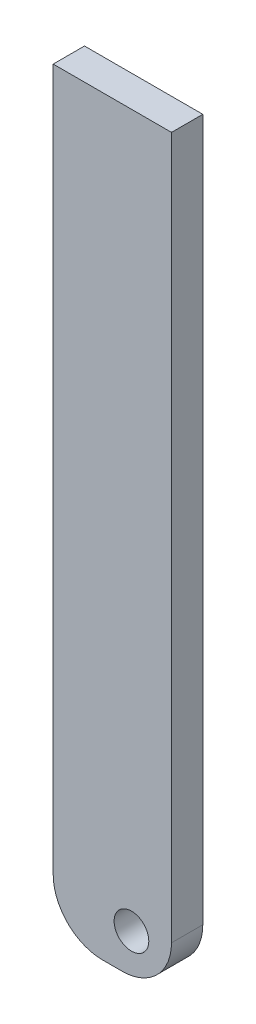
ISO-10303-21;
HEADER;
FILE_DESCRIPTION(('STEP AP214'),'2;1');
FILE_NAME('part.step','',(''),(''),'','','');
FILE_SCHEMA(('AUTOMOTIVE_DESIGN { 1 0 10303 214 1 1 1 1 }'));
ENDSEC;
DATA;
#1=APPLICATION_CONTEXT('core data for automotive mechanical design processes');
#2=APPLICATION_PROTOCOL_DEFINITION('international standard','automotive_design',2000,#1);
#3=PRODUCT_CONTEXT('',#1,'mechanical');
#4=PRODUCT('Part','Part','',(#3));
#5=PRODUCT_RELATED_PRODUCT_CATEGORY('part','',(#4));
#6=PRODUCT_DEFINITION_FORMATION('','',#4);
#7=PRODUCT_DEFINITION_CONTEXT('part definition',#1,'design');
#8=PRODUCT_DEFINITION('design','',#6,#7);
#9=PRODUCT_DEFINITION_SHAPE('','',#8);
#10=(LENGTH_UNIT() NAMED_UNIT(*) SI_UNIT(.MILLI.,.METRE.));
#11=(NAMED_UNIT(*) PLANE_ANGLE_UNIT() SI_UNIT($,.RADIAN.));
#12=(NAMED_UNIT(*) SI_UNIT($,.STERADIAN.) SOLID_ANGLE_UNIT());
#13=UNCERTAINTY_MEASURE_WITH_UNIT(LENGTH_MEASURE(1.E-05),#10,'distance_accuracy_value','');
#14=(GEOMETRIC_REPRESENTATION_CONTEXT(3) GLOBAL_UNCERTAINTY_ASSIGNED_CONTEXT((#13)) GLOBAL_UNIT_ASSIGNED_CONTEXT((#10,
#11,#12)) REPRESENTATION_CONTEXT('',''));
#15=CARTESIAN_POINT('',(0.,0.,0.));
#16=DIRECTION('',(0.,0.,1.));
#17=DIRECTION('',(1.,0.,0.));
#18=AXIS2_PLACEMENT_3D('',#15,#16,#17);
#19=CARTESIAN_POINT('',(0.,0.,6.35));
#20=DIRECTION('',(0.,0.,-1.));
#21=DIRECTION('',(-1.,0.,0.));
#22=AXIS2_PLACEMENT_3D('',#19,#20,#21);
#23=PLANE('',#22);
#24=DIRECTION('',(1.,0.,0.));
#25=VECTOR('',#24,1.);
#26=CARTESIAN_POINT('',(-15.875,-8.,6.35));
#27=LINE('',#26,#25);
#28=CARTESIAN_POINT('',(-5.87500000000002,-8.,6.35));
#29=VERTEX_POINT('',#28);
#30=CARTESIAN_POINT('',(-1.875,-8.,6.35));
#31=VERTEX_POINT('',#30);
#32=EDGE_CURVE('E97',#29,#31,#27,.T.);
#33=ORIENTED_EDGE('',*,*,#32,.T.);
#34=CARTESIAN_POINT('',(-1.875,2.,6.35));
#35=DIRECTION('',(0.,0.,-1.));
#36=DIRECTION('',(-1.,0.,0.));
#37=AXIS2_PLACEMENT_3D('',#34,#35,#36);
#38=CIRCLE('',#37,10.);
#39=CARTESIAN_POINT('',(8.125,2.00000000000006,6.35));
#40=VERTEX_POINT('',#39);
#41=EDGE_CURVE('E41',#31,#40,#38,.F.);
#42=ORIENTED_EDGE('',*,*,#41,.T.);
#43=DIRECTION('',(0.,1.,0.));
#44=VECTOR('',#43,1.);
#45=CARTESIAN_POINT('',(8.12499999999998,144.4,6.35));
#46=LINE('',#45,#44);
#47=CARTESIAN_POINT('',(8.12499999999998,144.4,6.35));
#48=VERTEX_POINT('',#47);
#49=EDGE_CURVE('E87',#40,#48,#46,.T.);
#50=ORIENTED_EDGE('',*,*,#49,.T.);
#51=DIRECTION('',(-1.,0.,0.));
#52=VECTOR('',#51,1.);
#53=CARTESIAN_POINT('',(-15.875,144.4,6.35));
#54=LINE('',#53,#52);
#55=CARTESIAN_POINT('',(-15.875,144.4,6.35));
#56=VERTEX_POINT('',#55);
#57=EDGE_CURVE('E91',#48,#56,#54,.T.);
#58=ORIENTED_EDGE('',*,*,#57,.T.);
#59=DIRECTION('',(0.,-1.,0.));
#60=VECTOR('',#59,1.);
#61=CARTESIAN_POINT('',(-15.875,-8.,6.35));
#62=LINE('',#61,#60);
#63=CARTESIAN_POINT('',(-15.875,1.99999999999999,6.35));
#64=VERTEX_POINT('',#63);
#65=EDGE_CURVE('E122',#56,#64,#62,.T.);
#66=ORIENTED_EDGE('',*,*,#65,.T.);
#67=CARTESIAN_POINT('',(-5.87500000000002,2.,6.35));
#68=DIRECTION('',(0.,0.,-1.));
#69=DIRECTION('',(-1.,0.,0.));
#70=AXIS2_PLACEMENT_3D('',#67,#68,#69);
#71=CIRCLE('',#70,10.);
#72=EDGE_CURVE('E133',#64,#29,#71,.F.);
#73=ORIENTED_EDGE('',*,*,#72,.T.);
#74=EDGE_LOOP('',(#33,#42,#50,#58,#66,#73));
#75=FACE_BOUND('',#74,.T.);
#76=CARTESIAN_POINT('',(0.,0.,6.35));
#77=DIRECTION('',(0.,0.,1.));
#78=DIRECTION('',(1.,0.,0.));
#79=AXIS2_PLACEMENT_3D('',#76,#77,#78);
#80=CIRCLE('',#79,3.5179);
#81=CARTESIAN_POINT('',(3.5179,0.,6.35));
#82=VERTEX_POINT('',#81);
#83=EDGE_CURVE('E118',#82,#82,#80,.T.);
#84=ORIENTED_EDGE('',*,*,#83,.F.);
#85=EDGE_LOOP('',(#84));
#86=FACE_BOUND('',#85,.T.);
#87=ADVANCED_FACE('F33',(#75,#86),#23,.F.);
#88=CARTESIAN_POINT('',(0.,0.,0.));
#89=DIRECTION('',(0.,0.,-1.));
#90=DIRECTION('',(-1.,0.,0.));
#91=AXIS2_PLACEMENT_3D('',#88,#89,#90);
#92=PLANE('',#91);
#93=DIRECTION('',(0.,1.,0.));
#94=VECTOR('',#93,1.);
#95=CARTESIAN_POINT('',(8.12499999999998,144.4,0.));
#96=LINE('',#95,#94);
#97=CARTESIAN_POINT('',(8.125,2.00000000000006,0.));
#98=VERTEX_POINT('',#97);
#99=CARTESIAN_POINT('',(8.12499999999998,144.4,0.));
#100=VERTEX_POINT('',#99);
#101=EDGE_CURVE('E103',#98,#100,#96,.T.);
#102=ORIENTED_EDGE('',*,*,#101,.F.);
#103=CARTESIAN_POINT('',(-1.875,2.,0.));
#104=DIRECTION('',(0.,0.,-1.));
#105=DIRECTION('',(-1.,0.,0.));
#106=AXIS2_PLACEMENT_3D('',#103,#104,#105);
#107=CIRCLE('',#106,10.);
#108=CARTESIAN_POINT('',(-1.875,-8.,0.));
#109=VERTEX_POINT('',#108);
#110=EDGE_CURVE('E127',#98,#109,#107,.T.);
#111=ORIENTED_EDGE('',*,*,#110,.T.);
#112=DIRECTION('',(1.,0.,0.));
#113=VECTOR('',#112,1.);
#114=CARTESIAN_POINT('',(-15.875,-8.,0.));
#115=LINE('',#114,#113);
#116=CARTESIAN_POINT('',(-5.87500000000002,-8.,0.));
#117=VERTEX_POINT('',#116);
#118=EDGE_CURVE('E117',#117,#109,#115,.T.);
#119=ORIENTED_EDGE('',*,*,#118,.F.);
#120=CARTESIAN_POINT('',(-5.87500000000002,2.,0.));
#121=DIRECTION('',(0.,0.,-1.));
#122=DIRECTION('',(-1.,0.,0.));
#123=AXIS2_PLACEMENT_3D('',#120,#121,#122);
#124=CIRCLE('',#123,10.);
#125=CARTESIAN_POINT('',(-15.875,1.99999999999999,0.));
#126=VERTEX_POINT('',#125);
#127=EDGE_CURVE('E125',#117,#126,#124,.T.);
#128=ORIENTED_EDGE('',*,*,#127,.T.);
#129=DIRECTION('',(0.,-1.,0.));
#130=VECTOR('',#129,1.);
#131=CARTESIAN_POINT('',(-15.875,-8.,0.));
#132=LINE('',#131,#130);
#133=CARTESIAN_POINT('',(-15.875,144.4,0.));
#134=VERTEX_POINT('',#133);
#135=EDGE_CURVE('E115',#134,#126,#132,.T.);
#136=ORIENTED_EDGE('',*,*,#135,.F.);
#137=DIRECTION('',(-1.,0.,0.));
#138=VECTOR('',#137,1.);
#139=CARTESIAN_POINT('',(-15.875,144.4,0.));
#140=LINE('',#139,#138);
#141=EDGE_CURVE('E121',#100,#134,#140,.T.);
#142=ORIENTED_EDGE('',*,*,#141,.F.);
#143=EDGE_LOOP('',(#102,#111,#119,#128,#136,#142));
#144=FACE_BOUND('',#143,.T.);
#145=CARTESIAN_POINT('',(0.,0.,0.));
#146=DIRECTION('',(0.,0.,1.));
#147=DIRECTION('',(1.,0.,0.));
#148=AXIS2_PLACEMENT_3D('',#145,#146,#147);
#149=CIRCLE('',#148,3.5179);
#150=CARTESIAN_POINT('',(3.5179,0.,0.));
#151=VERTEX_POINT('',#150);
#152=EDGE_CURVE('E146',#151,#151,#149,.T.);
#153=ORIENTED_EDGE('',*,*,#152,.T.);
#154=EDGE_LOOP('',(#153));
#155=FACE_BOUND('',#154,.T.);
#156=ADVANCED_FACE('F141',(#144,#155),#92,.T.);
#157=CARTESIAN_POINT('',(-15.875,-8.,6.35));
#158=DIRECTION('',(1.,0.,0.));
#159=DIRECTION('',(0.,0.,-1.));
#160=AXIS2_PLACEMENT_3D('',#157,#158,#159);
#161=PLANE('',#160);
#162=ORIENTED_EDGE('',*,*,#135,.T.);
#163=DIRECTION('',(0.,0.,-1.));
#164=VECTOR('',#163,1.);
#165=CARTESIAN_POINT('',(-15.875,2.,6.35));
#166=LINE('',#165,#164);
#167=EDGE_CURVE('E11',#126,#64,#166,.F.);
#168=ORIENTED_EDGE('',*,*,#167,.T.);
#169=ORIENTED_EDGE('',*,*,#65,.F.);
#170=DIRECTION('',(0.,0.,-1.));
#171=VECTOR('',#170,1.);
#172=CARTESIAN_POINT('',(-15.875,144.4,6.35));
#173=LINE('',#172,#171);
#174=EDGE_CURVE('E107',#56,#134,#173,.T.);
#175=ORIENTED_EDGE('',*,*,#174,.T.);
#176=EDGE_LOOP('',(#162,#168,#169,#175));
#177=FACE_BOUND('',#176,.T.);
#178=ADVANCED_FACE('F143',(#177),#161,.F.);
#179=CARTESIAN_POINT('',(-15.875,-8.,6.35));
#180=DIRECTION('',(0.,1.,0.));
#181=DIRECTION('',(-1.,0.,0.));
#182=AXIS2_PLACEMENT_3D('',#179,#180,#181);
#183=PLANE('',#182);
#184=ORIENTED_EDGE('',*,*,#118,.T.);
#185=DIRECTION('',(0.,0.,-1.));
#186=VECTOR('',#185,1.);
#187=CARTESIAN_POINT('',(-1.875,-8.,6.35));
#188=LINE('',#187,#186);
#189=EDGE_CURVE('E54',#109,#31,#188,.F.);
#190=ORIENTED_EDGE('',*,*,#189,.T.);
#191=ORIENTED_EDGE('',*,*,#32,.F.);
#192=DIRECTION('',(0.,0.,-1.));
#193=VECTOR('',#192,1.);
#194=CARTESIAN_POINT('',(-5.87500000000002,-8.,6.35));
#195=LINE('',#194,#193);
#196=EDGE_CURVE('E129',#29,#117,#195,.T.);
#197=ORIENTED_EDGE('',*,*,#196,.T.);
#198=EDGE_LOOP('',(#184,#190,#191,#197));
#199=FACE_BOUND('',#198,.T.);
#200=ADVANCED_FACE('F137',(#199),#183,.F.);
#201=CARTESIAN_POINT('',(8.12499999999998,144.4,6.35));
#202=DIRECTION('',(-1.,0.,0.));
#203=DIRECTION('',(0.,-1.,0.));
#204=AXIS2_PLACEMENT_3D('',#201,#202,#203);
#205=PLANE('',#204);
#206=ORIENTED_EDGE('',*,*,#49,.F.);
#207=DIRECTION('',(0.,0.,-1.));
#208=VECTOR('',#207,1.);
#209=CARTESIAN_POINT('',(8.125,2.,6.35));
#210=LINE('',#209,#208);
#211=EDGE_CURVE('E106',#40,#98,#210,.T.);
#212=ORIENTED_EDGE('',*,*,#211,.T.);
#213=ORIENTED_EDGE('',*,*,#101,.T.);
#214=DIRECTION('',(0.,0.,-1.));
#215=VECTOR('',#214,1.);
#216=CARTESIAN_POINT('',(8.12499999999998,144.4,6.35));
#217=LINE('',#216,#215);
#218=EDGE_CURVE('E100',#48,#100,#217,.T.);
#219=ORIENTED_EDGE('',*,*,#218,.F.);
#220=EDGE_LOOP('',(#206,#212,#213,#219));
#221=FACE_BOUND('',#220,.T.);
#222=ADVANCED_FACE('F101',(#221),#205,.F.);
#223=CARTESIAN_POINT('',(-15.875,144.4,6.35));
#224=DIRECTION('',(0.,-1.,0.));
#225=DIRECTION('',(0.,0.,-1.));
#226=AXIS2_PLACEMENT_3D('',#223,#224,#225);
#227=PLANE('',#226);
#228=ORIENTED_EDGE('',*,*,#141,.T.);
#229=ORIENTED_EDGE('',*,*,#174,.F.);
#230=ORIENTED_EDGE('',*,*,#57,.F.);
#231=ORIENTED_EDGE('',*,*,#218,.T.);
#232=EDGE_LOOP('',(#228,#229,#230,#231));
#233=FACE_BOUND('',#232,.T.);
#234=ADVANCED_FACE('F109',(#233),#227,.F.);
#235=CARTESIAN_POINT('',(0.,0.,6.35));
#236=DIRECTION('',(0.,0.,-1.));
#237=DIRECTION('',(-1.,0.,0.));
#238=AXIS2_PLACEMENT_3D('',#235,#236,#237);
#239=CYLINDRICAL_SURFACE('',#238,3.5179);
#240=ORIENTED_EDGE('',*,*,#83,.T.);
#241=EDGE_LOOP('',(#240));
#242=FACE_BOUND('',#241,.T.);
#243=ORIENTED_EDGE('',*,*,#152,.F.);
#244=EDGE_LOOP('',(#243));
#245=FACE_BOUND('',#244,.T.);
#246=ADVANCED_FACE('F152',(#242,#245),#239,.F.);
#247=CARTESIAN_POINT('',(-1.875,2.,6.35));
#248=DIRECTION('',(0.,0.,-1.));
#249=DIRECTION('',(-1.,0.,0.));
#250=AXIS2_PLACEMENT_3D('',#247,#248,#249);
#251=CYLINDRICAL_SURFACE('',#250,10.);
#252=ORIENTED_EDGE('',*,*,#41,.F.);
#253=ORIENTED_EDGE('',*,*,#189,.F.);
#254=ORIENTED_EDGE('',*,*,#110,.F.);
#255=ORIENTED_EDGE('',*,*,#211,.F.);
#256=EDGE_LOOP('',(#252,#253,#254,#255));
#257=FACE_BOUND('',#256,.T.);
#258=ADVANCED_FACE('F169',(#257),#251,.T.);
#259=CARTESIAN_POINT('',(-5.87500000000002,2.,6.35));
#260=DIRECTION('',(0.,0.,-1.));
#261=DIRECTION('',(-1.,0.,0.));
#262=AXIS2_PLACEMENT_3D('',#259,#260,#261);
#263=CYLINDRICAL_SURFACE('',#262,10.);
#264=ORIENTED_EDGE('',*,*,#72,.F.);
#265=ORIENTED_EDGE('',*,*,#167,.F.);
#266=ORIENTED_EDGE('',*,*,#127,.F.);
#267=ORIENTED_EDGE('',*,*,#196,.F.);
#268=EDGE_LOOP('',(#264,#265,#266,#267));
#269=FACE_BOUND('',#268,.T.);
#270=ADVANCED_FACE('F35',(#269),#263,.T.);
#271=CLOSED_SHELL('',(#87,#156,#178,#200,#222,#234,#246,#258,#270));
#272=MANIFOLD_SOLID_BREP('B2',#271);
#273=ADVANCED_BREP_SHAPE_REPRESENTATION('',(#18,#272),#14);
#274=SHAPE_DEFINITION_REPRESENTATION(#9,#273);
ENDSEC;
END-ISO-10303-21;
